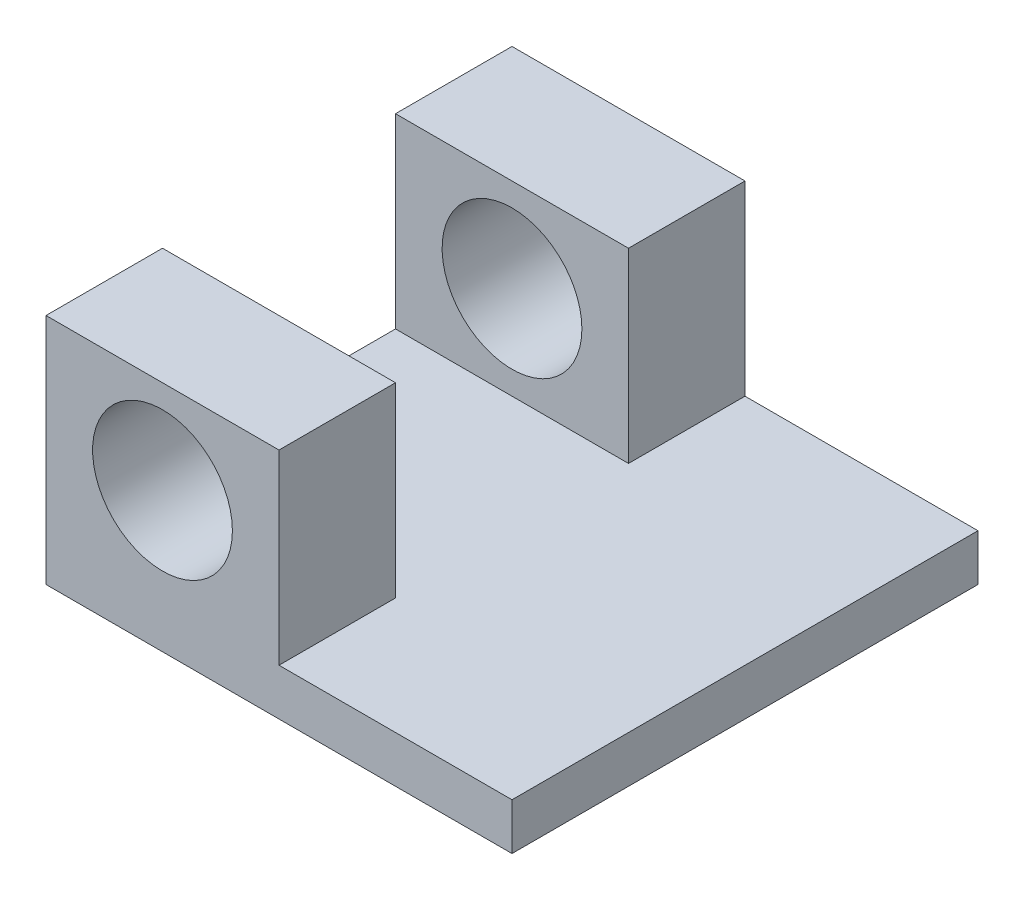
from build123d import *

# Parameters (mm, degrees)
SKETCH1_W           = 2.54
SKETCH1_H           = 1.27
EXTRUDE1_DEPTH      = 2.54
EXTRUDE2_DEPTH      = 4.81
EXTRUDE2_DEPTH_BACK = 4.81
SKETCH3_R           = 0.381
EXTRUDE3_DEPTH      = 4.81
EXTRUDE5_DEPTH      = 4.81
EXTRUDE5_DEPTH_BACK = 4.81


with BuildPart() as part:
    # Sketch1 → Extrude1 (new body)
    with BuildSketch(Plane.XY):
        with Locations((1.27, 0.635)):
            Rectangle(SKETCH1_W, SKETCH1_H)
    extrude(amount=EXTRUDE1_DEPTH)

    # Sketch2 → Extrude2 (cut, two sides: drawn at the far end of the back side and taken through both)
    with BuildSketch(Plane.XY.offset(2.54).offset(-EXTRUDE2_DEPTH_BACK)):
        Polygon((1.27, 16.741327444), (1.27, 1.27), (1.27, 0.254), (2.54, 0.254), (18.011327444, 0.254), (39.723205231, 22.300366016), (22.981877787, 38.78769346), align=None)
    extrude(amount=EXTRUDE2_DEPTH + EXTRUDE2_DEPTH_BACK, mode=Mode.SUBTRACT)

    # Sketch3 → Extrude3 (cut, through all)
    with BuildSketch(Plane.XY.offset(2.54)):
        with Locations((0.635, 0.762)):
            Circle(SKETCH3_R)
    extrude(amount=-EXTRUDE3_DEPTH, mode=Mode.SUBTRACT)

    # Sketch4 → Extrude5 (cut, two sides: drawn at the far end of the back side and taken through both)
    with BuildSketch(Plane.ZY.offset(-EXTRUDE5_DEPTH_BACK)):
        Polygon((1.905, 15.84905012), (1.905, 1.27), (1.905, 0.254), (0.635, 0.254), (0.635, 1.27), (0.635, 15.84905012), (0.635, 45.00715036), (1.905, 45.00715036), align=None)
    extrude(amount=EXTRUDE5_DEPTH + EXTRUDE5_DEPTH_BACK, mode=Mode.SUBTRACT)


solid = part.part
